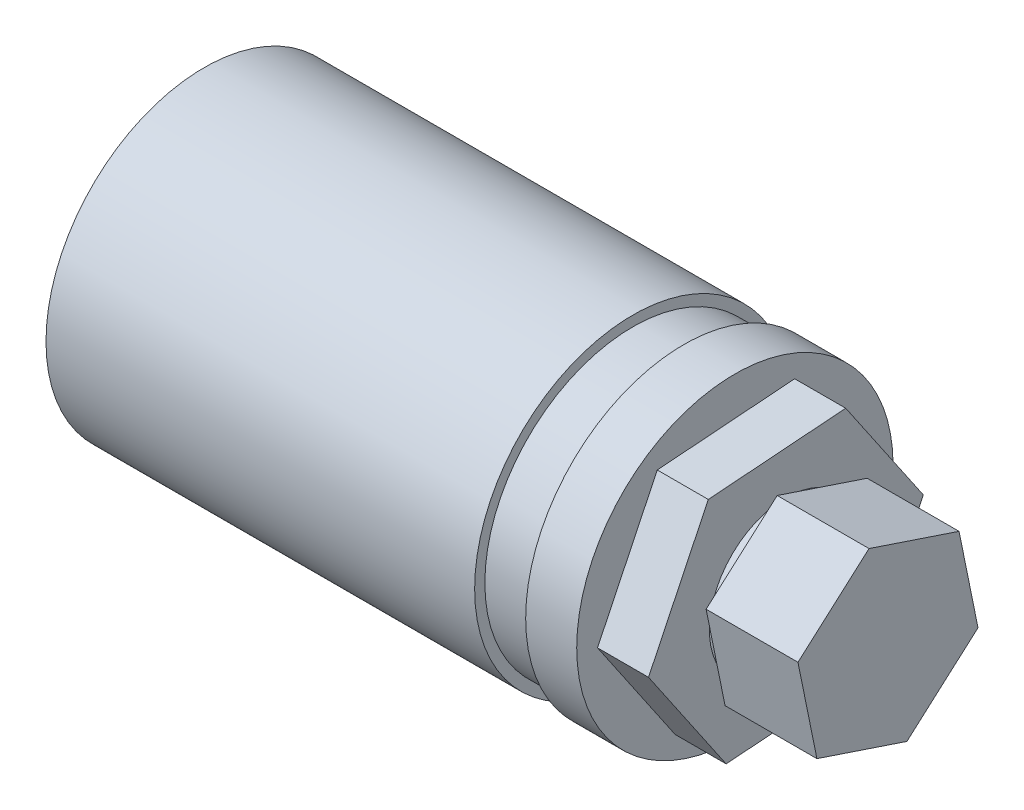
from build123d import *

# Parameters (mm, degrees)
SALIENTE_EXTRUIR1_DEPTH = 5
CROQUIS3_R              = 7.5
SALIENTE_EXTRUIR2_DEPTH = 1
SALIENTE_EXTRUIR3_DEPTH = 9


with BuildPart() as part:
    # Croquis1 → Revoluci_n1 (revolve)
    with BuildSketch(Plane.XY, mode=Mode.PRIVATE) as revoluci_n1_sk:
        Polygon((0, 0), (0, 15.5), (42, 15.5), (42, 14.5), (47, 14.5), (47, 15.5), (52, 15.5), (52, 0), align=None)
    revolve(revoluci_n1_sk.sketch.rotate(Axis((0, 0, 0), (1, 0, 0)), 90), axis=Axis((0, 0, 0), (1, 0, 0)))

    # Croquis2 → Saliente-Extruir1 (add)
    with BuildSketch(Plane(origin=(52, 0, 0), x_dir=(0, 0, -1), z_dir=(1, 0, 0))):
        Polygon((-7.605511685, 11.153752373), (-13.462188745, -1.009690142), (-5.85667706, -12.163442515), (7.605511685, -11.153752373), (13.462188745, 1.009690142), (5.85667706, 12.163442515), align=None)
    extrude(amount=SALIENTE_EXTRUIR1_DEPTH)

    # Croquis3 → Saliente-Extruir2 (add)
    with BuildSketch(Plane(origin=(57, 0, 0), x_dir=(0, 0, -1), z_dir=(1, 0, 0))):
        Circle(CROQUIS3_R)
    extrude(amount=SALIENTE_EXTRUIR2_DEPTH)

    # Croquis4 → Saliente-Extruir3 (add)
    with BuildSketch(Plane(origin=(58, 0, 0), x_dir=(0, 0, -1), z_dir=(1, 0, 0))):
        Polygon((-1.857707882, 9.11256942), (-8.820570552, 2.947462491), (-6.96286267, -6.165106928), (1.857707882, -9.11256942), (8.820570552, -2.947462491), (6.96286267, 6.165106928), align=None)
    extrude(amount=SALIENTE_EXTRUIR3_DEPTH)


solid = part.part
